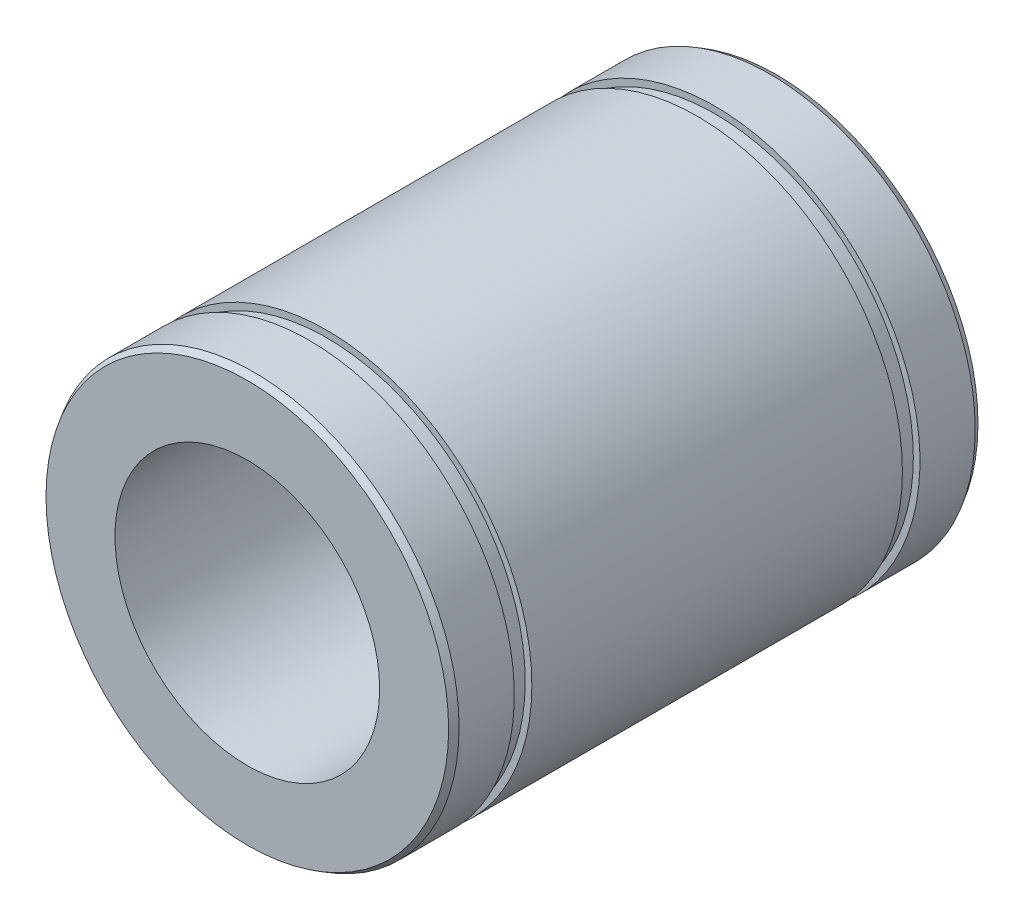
from build123d import *

# Parameters (mm, degrees)
ESQUISSE1_R      = 31
ESQUISSE1_R_2    = 20
EXTRUSION1_DEPTH = 40
CHANFREIN1_SIZE  = 1
CHANFREIN1_SIZE2 = 0.577350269
ESQUISSE2_W      = 2.65
ESQUISSE2_H      = 10


with BuildPart() as part:
    # Esquisse1 → Extrusion1 (new body)
    with BuildSketch(Plane.XY):
        Circle(ESQUISSE1_R)
        Circle(ESQUISSE1_R_2, mode=Mode.SUBTRACT)
    extrude(amount=EXTRUSION1_DEPTH)

    # Chanfrein1
    chanfrein1_edges = [part.edges().sort_by_distance(p)[0] for p in [
        (-31, 0, 40),
    ]]
    chanfrein1_side = [part.faces().sort_by_distance(p)[0] for p in [
        (-31, 0, 20),
    ]]
    chamfer(chanfrein1_edges, length=CHANFREIN1_SIZE, length2=CHANFREIN1_SIZE2, reference=chanfrein1_side[0])

    # Esquisse2 → Enl_vement de mati_re-R_volution1 (revolve, cut)
    with BuildSketch(Plane(origin=(0, 0, 0), x_dir=(0, 0, -1), z_dir=(1, 0, 0)), mode=Mode.PRIVATE) as enl_vement_de_mati_re_r_volution1_sk:
        with Locations((-29.325, 35)):
            Rectangle(ESQUISSE2_W, ESQUISSE2_H)
    revolve(enl_vement_de_mati_re_r_volution1_sk.sketch.rotate(Axis((0, 0, 40), (0, 0, -1)), 90), axis=Axis((0, 0, 40), (0, 0, -1)), mode=Mode.SUBTRACT)

    # Sym_trie1: part across plane


with BuildPart() as part_1:
    add(part.part)
    add(part.part.mirror(Plane.XY))


solid = part_1.part
